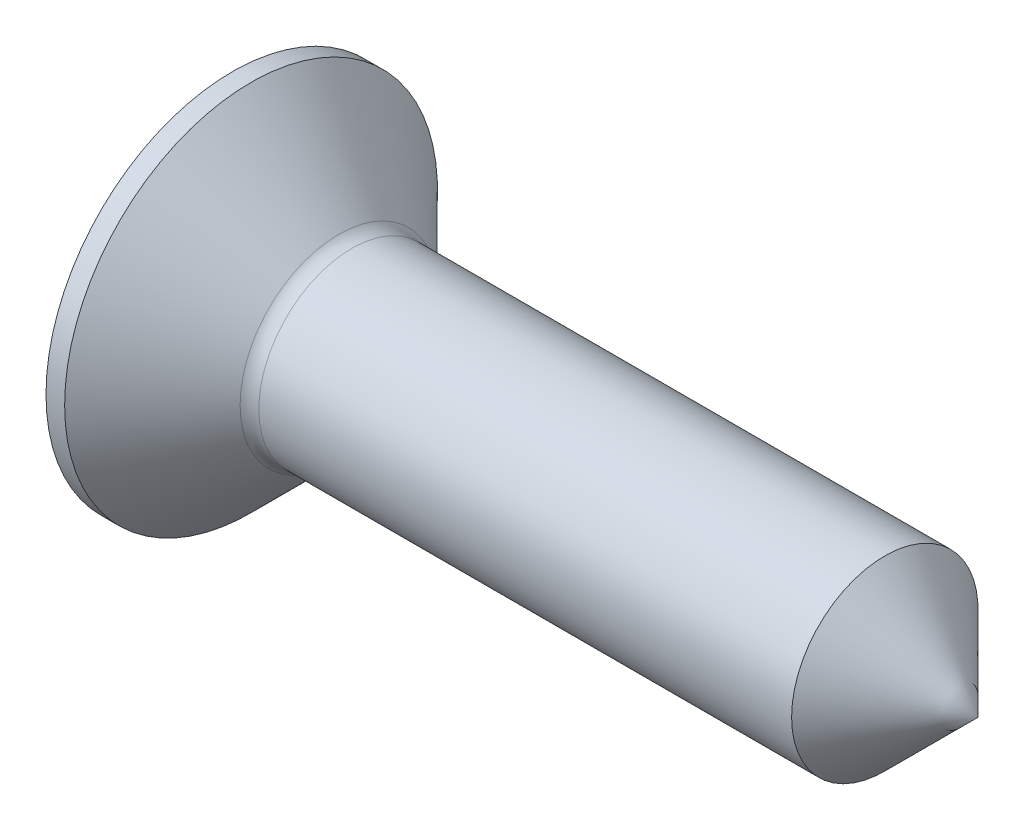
from build123d import *

# Parameters (mm, degrees)
FILLET2_R = 0.2


with BuildPart() as part:
    # Sketch1 → Base (revolve)
    with BuildSketch(Plane(origin=(0, 0, 0), x_dir=(1, 0, 0), z_dir=(0, 1, 0)), mode=Mode.PRIVATE) as base_sk:
        Polygon((1.2, 1), (8, 1), (8, 0), (0, 0), (0, 2), (0.2, 2), align=None)
    revolve(base_sk.sketch.rotate(Axis((-6.506452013, 0, 0), (1, 0, 0)), 180), axis=Axis((-6.506452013, 0, 0), (1, 0, 0)))

    # Sketch3 → Cut-Revolve1 (revolve, cut)
    with BuildSketch(Plane.XY, mode=Mode.PRIVATE) as cut_revolve1_sk:
        Polygon((8.15755877, 0), (8.15755877, 20), (-12, 20), (8, 0), align=None)
    revolve(cut_revolve1_sk.sketch.rotate(Axis((4.883468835, 0, 0), (1, 0, 0)), 90), axis=Axis((4.883468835, 0, 0), (1, 0, 0)), mode=Mode.SUBTRACT)

    # Fillet2
    fillet2_edges = [part.edges().sort_by_distance(p)[0] for p in [
        (1.2, 0, -1),
    ]]
    fillet(fillet2_edges, radius=FILLET2_R)

    # Sketch2 → Cut-Loft1 section 0
    with BuildSketch(Plane(origin=(0, -0.680816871, 0.306758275), x_dir=(0, 0, 1), z_dir=(-1, 0, 0)), mode=Mode.PRIVATE) as cut_loft1_s0:
        with BuildLine():
            Line((-0.556758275, 0.930816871), (-1.556758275, 0.930816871))
            Line((-1.556758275, 0.930816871), (-1.556758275, 0.430816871))
            Line((-1.556758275, 0.430816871), (-0.556758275, 0.430816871))
            Line((-0.556758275, 0.430816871), (-0.556758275, -0.569183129))
            Line((-0.556758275, -0.569183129), (-0.056758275, -0.569183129))
            Line((-0.056758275, -0.569183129), (-0.056758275, 0.430816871))
            Line((-0.056758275, 0.430816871), (0.943241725, 0.430816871))
            Line((0.943241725, 0.430816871), (0.943241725, 0.930816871))
            Line((0.943241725, 0.930816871), (-0.056758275, 0.930816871))
            Line((-0.056758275, 0.930816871), (-0.056758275, 1.930816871))
            Line((-0.056758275, 1.930816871), (-0.556758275, 1.930816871))
            Line((-0.556758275, 1.930816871), (-0.556758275, 0.930816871))
        make_face()
    loft([cut_loft1_s0.sketch, Vertex(1.45, 0, 0)], mode=Mode.SUBTRACT)


solid = part.part
